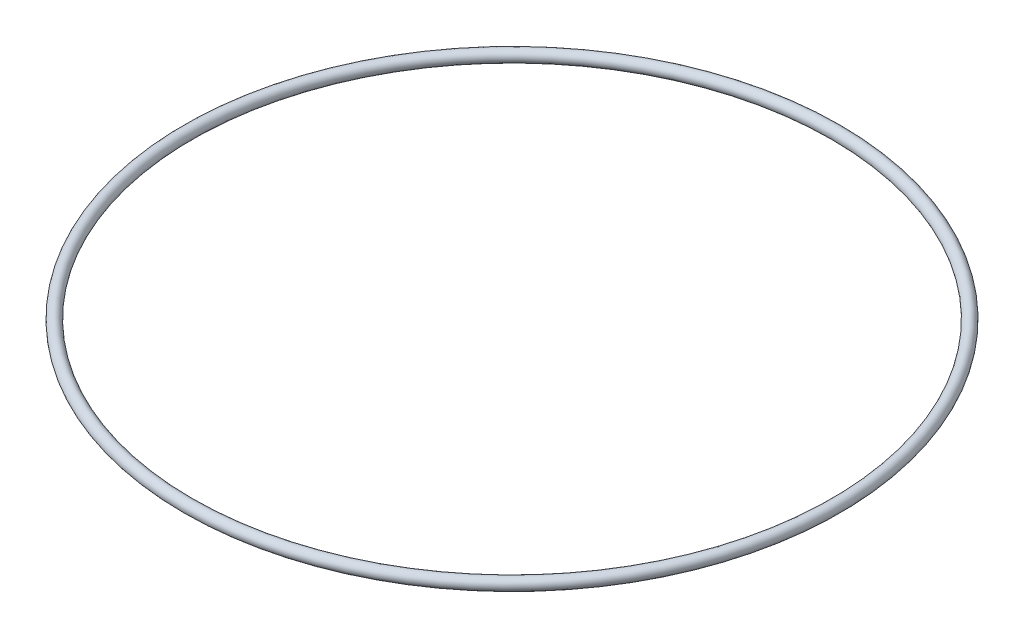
ISO-10303-21;
HEADER;
FILE_DESCRIPTION(('STEP AP214'),'2;1');
FILE_NAME('part.step','',(''),(''),'','','');
FILE_SCHEMA(('AUTOMOTIVE_DESIGN { 1 0 10303 214 1 1 1 1 }'));
ENDSEC;
DATA;
#1=APPLICATION_CONTEXT('core data for automotive mechanical design processes');
#2=APPLICATION_PROTOCOL_DEFINITION('international standard','automotive_design',2000,#1);
#3=PRODUCT_CONTEXT('',#1,'mechanical');
#4=PRODUCT('Part','Part','',(#3));
#5=PRODUCT_RELATED_PRODUCT_CATEGORY('part','',(#4));
#6=PRODUCT_DEFINITION_FORMATION('','',#4);
#7=PRODUCT_DEFINITION_CONTEXT('part definition',#1,'design');
#8=PRODUCT_DEFINITION('design','',#6,#7);
#9=PRODUCT_DEFINITION_SHAPE('','',#8);
#10=(LENGTH_UNIT() NAMED_UNIT(*) SI_UNIT(.MILLI.,.METRE.));
#11=(NAMED_UNIT(*) PLANE_ANGLE_UNIT() SI_UNIT($,.RADIAN.));
#12=(NAMED_UNIT(*) SI_UNIT($,.STERADIAN.) SOLID_ANGLE_UNIT());
#13=UNCERTAINTY_MEASURE_WITH_UNIT(LENGTH_MEASURE(1.E-05),#10,'distance_accuracy_value','');
#14=(GEOMETRIC_REPRESENTATION_CONTEXT(3) GLOBAL_UNCERTAINTY_ASSIGNED_CONTEXT((#13)) GLOBAL_UNIT_ASSIGNED_CONTEXT((#10,
#11,#12)) REPRESENTATION_CONTEXT('',''));
#15=CARTESIAN_POINT('',(0.,0.,0.));
#16=DIRECTION('',(0.,0.,1.));
#17=DIRECTION('',(1.,0.,0.));
#18=AXIS2_PLACEMENT_3D('',#15,#16,#17);
#19=CARTESIAN_POINT('',(0.,0.,0.));
#20=DIRECTION('',(0.,1.,0.));
#21=DIRECTION('',(0.,0.,1.));
#22=AXIS2_PLACEMENT_3D('',#19,#20,#21);
#23=TOROIDAL_SURFACE('',#22,68.75,1.25);
#24=CARTESIAN_POINT('',(0.,0.,70.));
#25=VERTEX_POINT('',#24);
#26=VERTEX_LOOP('',#25);
#27=FACE_BOUND('',#26,.T.);
#28=ADVANCED_FACE('F29',(#27),#23,.T.);
#29=CLOSED_SHELL('',(#28));
#30=MANIFOLD_SOLID_BREP('B2',#29);
#31=ADVANCED_BREP_SHAPE_REPRESENTATION('',(#18,#30),#14);
#32=SHAPE_DEFINITION_REPRESENTATION(#9,#31);
ENDSEC;
END-ISO-10303-21;
